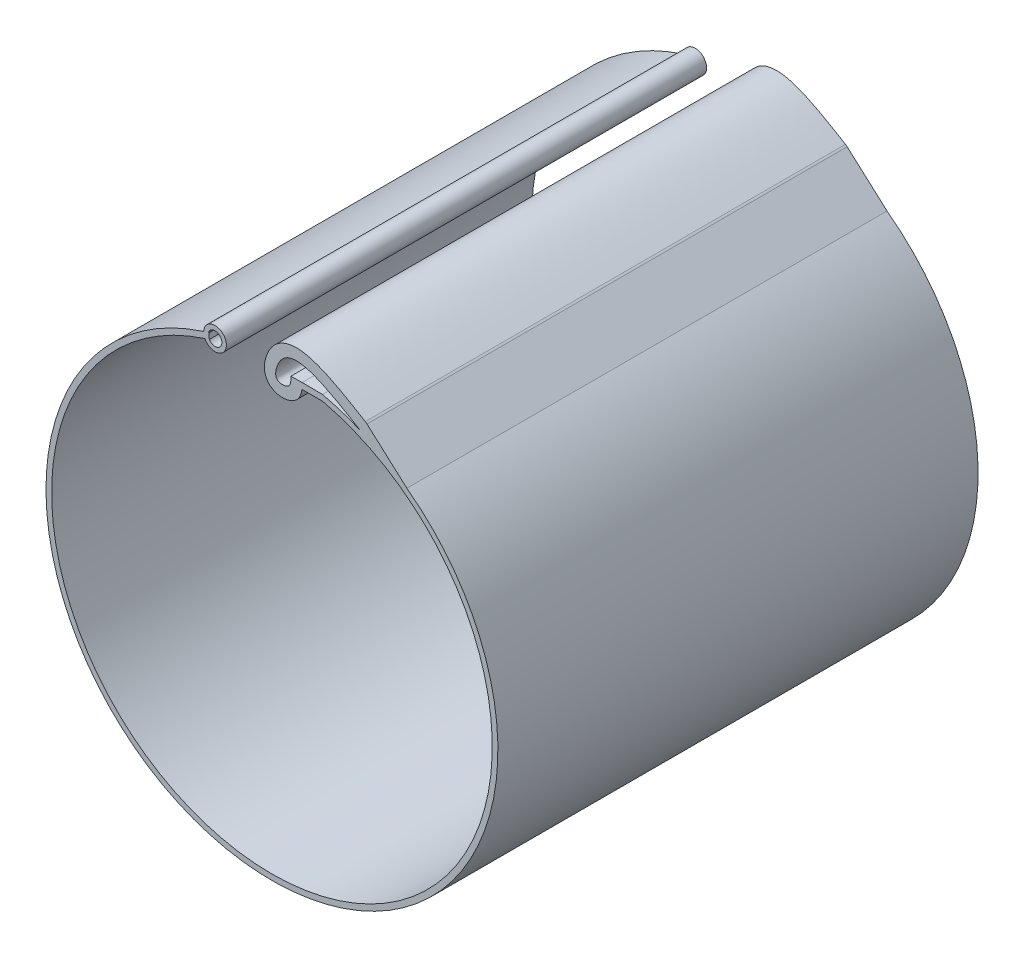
ISO-10303-21;
HEADER;
FILE_DESCRIPTION(('STEP AP214'),'2;1');
FILE_NAME('part.step','',(''),(''),'','','');
FILE_SCHEMA(('AUTOMOTIVE_DESIGN { 1 0 10303 214 1 1 1 1 }'));
ENDSEC;
DATA;
#1=APPLICATION_CONTEXT('core data for automotive mechanical design processes');
#2=APPLICATION_PROTOCOL_DEFINITION('international standard','automotive_design',2000,#1);
#3=PRODUCT_CONTEXT('',#1,'mechanical');
#4=PRODUCT('Part','Part','',(#3));
#5=PRODUCT_RELATED_PRODUCT_CATEGORY('part','',(#4));
#6=PRODUCT_DEFINITION_FORMATION('','',#4);
#7=PRODUCT_DEFINITION_CONTEXT('part definition',#1,'design');
#8=PRODUCT_DEFINITION('design','',#6,#7);
#9=PRODUCT_DEFINITION_SHAPE('','',#8);
#10=(LENGTH_UNIT() NAMED_UNIT(*) SI_UNIT(.MILLI.,.METRE.));
#11=(NAMED_UNIT(*) PLANE_ANGLE_UNIT() SI_UNIT($,.RADIAN.));
#12=(NAMED_UNIT(*) SI_UNIT($,.STERADIAN.) SOLID_ANGLE_UNIT());
#13=UNCERTAINTY_MEASURE_WITH_UNIT(LENGTH_MEASURE(1.E-05),#10,'distance_accuracy_value','');
#14=(GEOMETRIC_REPRESENTATION_CONTEXT(3) GLOBAL_UNCERTAINTY_ASSIGNED_CONTEXT((#13)) GLOBAL_UNIT_ASSIGNED_CONTEXT((#10,
#11,#12)) REPRESENTATION_CONTEXT('',''));
#15=CARTESIAN_POINT('',(0.,0.,0.));
#16=DIRECTION('',(0.,0.,1.));
#17=DIRECTION('',(1.,0.,0.));
#18=AXIS2_PLACEMENT_3D('',#15,#16,#17);
#19=CARTESIAN_POINT('',(6.78343566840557,49.5560398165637,-35.3801183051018));
#20=CARTESIAN_POINT('',(6.78636089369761,49.381244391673,-35.3801183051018));
#21=CARTESIAN_POINT('',(6.79219193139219,49.0584914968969,-35.3801183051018));
#22=CARTESIAN_POINT('',(6.77588924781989,48.4130139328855,-35.3801183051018));
#23=CARTESIAN_POINT('',(6.68189546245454,47.654921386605,-35.3801183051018));
#24=CARTESIAN_POINT('',(6.40887164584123,46.7400923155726,-35.3801183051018));
#25=CARTESIAN_POINT('',(5.89603806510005,45.9084718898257,-35.3801183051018));
#26=CARTESIAN_POINT('',(5.27434765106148,45.3276309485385,-35.3801183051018));
#27=CARTESIAN_POINT('',(4.63102221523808,44.9013269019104,-35.3801183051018));
#28=CARTESIAN_POINT('',(3.84547745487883,44.5840613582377,-35.3801183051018));
#29=CARTESIAN_POINT('',(2.92820073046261,44.4075050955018,-35.3801183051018));
#30=CARTESIAN_POINT('',(2.0088844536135,44.3912916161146,-35.3801183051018));
#31=CARTESIAN_POINT('',(1.0576059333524,44.5478604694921,-35.3801183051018));
#32=CARTESIAN_POINT('',(0.209510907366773,44.8862011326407,-35.3801183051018));
#33=CARTESIAN_POINT('',(-0.494715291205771,45.3977391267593,-35.3801183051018));
#34=CARTESIAN_POINT('',(-1.12567048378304,46.0872518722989,-35.3801183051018));
#35=CARTESIAN_POINT('',(-1.56694919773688,47.0320088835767,-35.3801183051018));
#36=CARTESIAN_POINT('',(-1.72123436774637,48.029437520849,-35.3801183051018));
#37=CARTESIAN_POINT('',(-1.69265827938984,48.8723229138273,-35.3801183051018));
#38=CARTESIAN_POINT('',(-1.52853335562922,49.8578066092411,-35.3801183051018));
#39=CARTESIAN_POINT('',(-1.21259029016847,50.8702288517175,-35.3801183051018));
#40=CARTESIAN_POINT('',(-0.74789788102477,51.9469770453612,-35.3801183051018));
#41=CARTESIAN_POINT('',(-0.144994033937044,52.9385397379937,-35.3801183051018));
#42=CARTESIAN_POINT('',(0.840566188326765,54.1022162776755,-35.3801183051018));
#43=CARTESIAN_POINT('',(2.41065918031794,55.1808248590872,-35.3801183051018));
#44=CARTESIAN_POINT('',(4.51104114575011,55.7203292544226,-35.3801183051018));
#45=CARTESIAN_POINT('',(6.57493501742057,55.6874203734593,-35.3801183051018));
#46=CARTESIAN_POINT('',(8.60172449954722,55.2771898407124,-35.3801183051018));
#47=CARTESIAN_POINT('',(10.6328352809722,54.5926931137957,-35.3801183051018));
#48=CARTESIAN_POINT('',(13.379183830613,53.3980550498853,-35.3801183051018));
#49=CARTESIAN_POINT('',(16.903298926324,51.4974200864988,-35.3801183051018));
#50=CARTESIAN_POINT('',(19.7682073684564,49.7777451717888,-35.3801183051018));
#51=CARTESIAN_POINT('',(21.1855773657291,48.9270399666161,-35.3801183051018));
#52=B_SPLINE_CURVE_WITH_KNOTS('',3,(#19,#20,#21,#22,#23,#24,#25,#26,#27,#28,#29,#30,#31,#32,#33,
#34,#35,#36,#37,#38,#39,#40,#41,#42,#43,#44,#45,#46,#47,#48,#49,#50,#51),.UNSPECIFIED.,.F.,.F.,
(4,1,1,1,1,1,1,1,1,1,1,1,1,1,1,1,1,1,1,1,1,1,1,1,1,1,1,1,1,1,4),(0.,0.015625,0.03125,0.046875,
0.0625,0.078125,0.0859375,0.09375,0.109375,0.125,0.140625,0.15625,0.171875,0.1796875,0.1875,
0.203125,0.21875,0.234375,0.25,0.28125,0.3125,0.34375,0.375,0.4375,0.5,0.5625,0.625,0.6875,0.75,
0.875,1.),.UNSPECIFIED.);
#53=DIRECTION('',(0.,0.,1.));
#54=VECTOR('',#53,1.);
#55=SURFACE_OF_LINEAR_EXTRUSION('',#52,#54);
#56=CARTESIAN_POINT('',(6.78343566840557,49.5560398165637,107.95));
#57=CARTESIAN_POINT('',(6.78636089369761,49.381244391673,107.95));
#58=CARTESIAN_POINT('',(6.79219193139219,49.0584914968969,107.95));
#59=CARTESIAN_POINT('',(6.77588924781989,48.4130139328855,107.95));
#60=CARTESIAN_POINT('',(6.68189546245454,47.654921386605,107.95));
#61=CARTESIAN_POINT('',(6.40887164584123,46.7400923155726,107.95));
#62=CARTESIAN_POINT('',(5.89603806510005,45.9084718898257,107.95));
#63=CARTESIAN_POINT('',(5.27434765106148,45.3276309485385,107.95));
#64=CARTESIAN_POINT('',(4.63102221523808,44.9013269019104,107.95));
#65=CARTESIAN_POINT('',(3.84547745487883,44.5840613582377,107.95));
#66=CARTESIAN_POINT('',(2.92820073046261,44.4075050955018,107.95));
#67=CARTESIAN_POINT('',(2.0088844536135,44.3912916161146,107.95));
#68=CARTESIAN_POINT('',(1.0576059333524,44.5478604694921,107.95));
#69=CARTESIAN_POINT('',(0.209510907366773,44.8862011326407,107.95));
#70=CARTESIAN_POINT('',(-0.494715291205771,45.3977391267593,107.95));
#71=CARTESIAN_POINT('',(-1.12567048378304,46.0872518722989,107.95));
#72=CARTESIAN_POINT('',(-1.56694919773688,47.0320088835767,107.95));
#73=CARTESIAN_POINT('',(-1.72123436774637,48.029437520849,107.95));
#74=CARTESIAN_POINT('',(-1.69265827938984,48.8723229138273,107.95));
#75=CARTESIAN_POINT('',(-1.52853335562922,49.8578066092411,107.95));
#76=CARTESIAN_POINT('',(-1.21259029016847,50.8702288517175,107.95));
#77=CARTESIAN_POINT('',(-0.74789788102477,51.9469770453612,107.95));
#78=CARTESIAN_POINT('',(-0.144994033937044,52.9385397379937,107.95));
#79=CARTESIAN_POINT('',(0.840566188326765,54.1022162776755,107.95));
#80=CARTESIAN_POINT('',(2.41065918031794,55.1808248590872,107.95));
#81=CARTESIAN_POINT('',(4.51104114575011,55.7203292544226,107.95));
#82=CARTESIAN_POINT('',(6.57493501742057,55.6874203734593,107.95));
#83=CARTESIAN_POINT('',(8.60172449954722,55.2771898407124,107.95));
#84=CARTESIAN_POINT('',(10.6328352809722,54.5926931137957,107.95));
#85=CARTESIAN_POINT('',(13.379183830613,53.3980550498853,107.95));
#86=CARTESIAN_POINT('',(16.903298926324,51.4974200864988,107.95));
#87=CARTESIAN_POINT('',(19.7682073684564,49.7777451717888,107.95));
#88=CARTESIAN_POINT('',(21.1855773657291,48.9270399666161,107.95));
#89=B_SPLINE_CURVE_WITH_KNOTS('',3,(#56,#57,#58,#59,#60,#61,#62,#63,#64,#65,#66,#67,#68,#69,#70,
#71,#72,#73,#74,#75,#76,#77,#78,#79,#80,#81,#82,#83,#84,#85,#86,#87,#88),.UNSPECIFIED.,.F.,.F.,
(4,1,1,1,1,1,1,1,1,1,1,1,1,1,1,1,1,1,1,1,1,1,1,1,1,1,1,1,1,1,4),(0.,0.015625,0.03125,0.046875,
0.0625,0.078125,0.0859375,0.09375,0.109375,0.125,0.140625,0.15625,0.171875,0.1796875,0.1875,
0.203125,0.21875,0.234375,0.25,0.28125,0.3125,0.34375,0.375,0.4375,0.5,0.5625,0.625,0.6875,0.75,
0.875,1.),.UNSPECIFIED.);
#90=CARTESIAN_POINT('',(6.74493362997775,48.2009473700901,107.95));
#91=VERTEX_POINT('',#90);
#92=CARTESIAN_POINT('',(20.9792078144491,49.050898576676,107.95));
#93=VERTEX_POINT('',#92);
#94=EDGE_CURVE('E150',#91,#93,#89,.T.);
#95=ORIENTED_EDGE('',*,*,#94,.T.);
#96=DIRECTION('',(0.,0.,1.));
#97=VECTOR('',#96,1.);
#98=CARTESIAN_POINT('',(20.9792078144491,49.050898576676,107.95));
#99=LINE('',#98,#97);
#100=CARTESIAN_POINT('',(20.9792078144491,49.050898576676,0.));
#101=VERTEX_POINT('',#100);
#102=EDGE_CURVE('E39',#93,#101,#99,.F.);
#103=ORIENTED_EDGE('',*,*,#102,.T.);
#104=CARTESIAN_POINT('',(6.78343566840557,49.5560398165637,0.));
#105=CARTESIAN_POINT('',(6.78636089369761,49.381244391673,0.));
#106=CARTESIAN_POINT('',(6.79219193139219,49.0584914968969,0.));
#107=CARTESIAN_POINT('',(6.77588924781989,48.4130139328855,0.));
#108=CARTESIAN_POINT('',(6.68189546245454,47.654921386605,0.));
#109=CARTESIAN_POINT('',(6.40887164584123,46.7400923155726,0.));
#110=CARTESIAN_POINT('',(5.89603806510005,45.9084718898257,0.));
#111=CARTESIAN_POINT('',(5.27434765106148,45.3276309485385,0.));
#112=CARTESIAN_POINT('',(4.63102221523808,44.9013269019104,0.));
#113=CARTESIAN_POINT('',(3.84547745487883,44.5840613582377,0.));
#114=CARTESIAN_POINT('',(2.92820073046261,44.4075050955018,0.));
#115=CARTESIAN_POINT('',(2.0088844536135,44.3912916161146,0.));
#116=CARTESIAN_POINT('',(1.0576059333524,44.5478604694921,0.));
#117=CARTESIAN_POINT('',(0.209510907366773,44.8862011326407,0.));
#118=CARTESIAN_POINT('',(-0.494715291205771,45.3977391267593,0.));
#119=CARTESIAN_POINT('',(-1.12567048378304,46.0872518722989,0.));
#120=CARTESIAN_POINT('',(-1.56694919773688,47.0320088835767,0.));
#121=CARTESIAN_POINT('',(-1.72123436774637,48.029437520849,0.));
#122=CARTESIAN_POINT('',(-1.69265827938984,48.8723229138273,0.));
#123=CARTESIAN_POINT('',(-1.52853335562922,49.8578066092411,0.));
#124=CARTESIAN_POINT('',(-1.21259029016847,50.8702288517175,0.));
#125=CARTESIAN_POINT('',(-0.74789788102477,51.9469770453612,0.));
#126=CARTESIAN_POINT('',(-0.144994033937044,52.9385397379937,0.));
#127=CARTESIAN_POINT('',(0.840566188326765,54.1022162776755,0.));
#128=CARTESIAN_POINT('',(2.41065918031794,55.1808248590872,0.));
#129=CARTESIAN_POINT('',(4.51104114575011,55.7203292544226,0.));
#130=CARTESIAN_POINT('',(6.57493501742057,55.6874203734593,0.));
#131=CARTESIAN_POINT('',(8.60172449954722,55.2771898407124,0.));
#132=CARTESIAN_POINT('',(10.6328352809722,54.5926931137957,0.));
#133=CARTESIAN_POINT('',(13.379183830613,53.3980550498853,0.));
#134=CARTESIAN_POINT('',(16.903298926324,51.4974200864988,0.));
#135=CARTESIAN_POINT('',(19.7682073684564,49.7777451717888,0.));
#136=CARTESIAN_POINT('',(21.1855773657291,48.9270399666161,0.));
#137=B_SPLINE_CURVE_WITH_KNOTS('',3,(#104,#105,#106,#107,#108,#109,#110,#111,#112,#113,#114,
#115,#116,#117,#118,#119,#120,#121,#122,#123,#124,#125,#126,#127,#128,#129,#130,#131,#132,#133,
#134,#135,#136),.UNSPECIFIED.,.F.,.F.,(4,1,1,1,1,1,1,1,1,1,1,1,1,1,1,1,1,1,1,1,1,1,1,1,1,1,1,1,
1,1,4),(0.,0.015625,0.03125,0.046875,0.0625,0.078125,0.0859375,0.09375,0.109375,0.125,0.140625,
0.15625,0.171875,0.1796875,0.1875,0.203125,0.21875,0.234375,0.25,0.28125,0.3125,0.34375,0.375,
0.4375,0.5,0.5625,0.625,0.6875,0.75,0.875,1.),.UNSPECIFIED.);
#138=CARTESIAN_POINT('',(6.74493362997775,48.2009473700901,0.));
#139=VERTEX_POINT('',#138);
#140=EDGE_CURVE('E225',#101,#139,#137,.F.);
#141=ORIENTED_EDGE('',*,*,#140,.T.);
#142=DIRECTION('',(0.,0.,1.));
#143=VECTOR('',#142,1.);
#144=CARTESIAN_POINT('',(6.74493362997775,48.2009473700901,-4.84532420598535));
#145=LINE('',#144,#143);
#146=EDGE_CURVE('E304',#139,#91,#145,.T.);
#147=ORIENTED_EDGE('',*,*,#146,.T.);
#148=EDGE_LOOP('',(#95,#103,#141,#147));
#149=FACE_BOUND('',#148,.T.);
#150=ADVANCED_FACE('F31',(#149),#55,.F.);
#151=CARTESIAN_POINT('',(0.,0.,107.95));
#152=DIRECTION('',(0.,0.,-1.));
#153=DIRECTION('',(-1.,0.,0.));
#154=AXIS2_PLACEMENT_3D('',#151,#152,#153);
#155=CYLINDRICAL_SURFACE('',#154,50.8);
#156=DIRECTION('',(0.,0.,1.));
#157=VECTOR('',#156,1.);
#158=CARTESIAN_POINT('',(30.3348883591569,40.74843000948,-35.3801183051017));
#159=LINE('',#158,#157);
#160=CARTESIAN_POINT('',(30.3348883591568,40.74843000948,0.));
#161=VERTEX_POINT('',#160);
#162=CARTESIAN_POINT('',(30.3348883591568,40.74843000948,107.95));
#163=VERTEX_POINT('',#162);
#164=EDGE_CURVE('E204',#161,#163,#159,.T.);
#165=ORIENTED_EDGE('',*,*,#164,.T.);
#166=CARTESIAN_POINT('',(0.,0.,107.95));
#167=DIRECTION('',(0.,0.,1.));
#168=DIRECTION('',(1.,0.,0.));
#169=AXIS2_PLACEMENT_3D('',#166,#167,#168);
#170=CIRCLE('',#169,50.8);
#171=CARTESIAN_POINT('',(-15.3477671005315,48.4260884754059,107.95));
#172=VERTEX_POINT('',#171);
#173=EDGE_CURVE('E167',#172,#163,#170,.T.);
#174=ORIENTED_EDGE('',*,*,#173,.F.);
#175=DIRECTION('',(0.,0.,1.));
#176=VECTOR('',#175,1.);
#177=CARTESIAN_POINT('',(-15.3477671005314,48.4260884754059,53.975));
#178=LINE('',#177,#176);
#179=CARTESIAN_POINT('',(-15.3477671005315,48.4260884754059,0.));
#180=VERTEX_POINT('',#179);
#181=EDGE_CURVE('E233',#172,#180,#178,.F.);
#182=ORIENTED_EDGE('',*,*,#181,.T.);
#183=CARTESIAN_POINT('',(0.,0.,0.));
#184=DIRECTION('',(0.,0.,1.));
#185=DIRECTION('',(1.,0.,0.));
#186=AXIS2_PLACEMENT_3D('',#183,#184,#185);
#187=CIRCLE('',#186,50.8);
#188=EDGE_CURVE('E171',#180,#161,#187,.T.);
#189=ORIENTED_EDGE('',*,*,#188,.T.);
#190=EDGE_LOOP('',(#165,#174,#182,#189));
#191=FACE_BOUND('',#190,.T.);
#192=ADVANCED_FACE('F265',(#191),#155,.T.);
#193=DIRECTION('',(0.,0.,1.));
#194=VECTOR('',#193,1.);
#195=CARTESIAN_POINT('',(-14.2711679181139,48.754217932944,53.975));
#196=LINE('',#195,#194);
#197=CARTESIAN_POINT('',(-14.2711679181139,48.754217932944,107.95));
#198=VERTEX_POINT('',#197);
#199=CARTESIAN_POINT('',(-14.2711679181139,48.754217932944,0.));
#200=VERTEX_POINT('',#199);
#201=EDGE_CURVE('E229',#198,#200,#196,.F.);
#202=ORIENTED_EDGE('',*,*,#201,.F.);
#203=CARTESIAN_POINT('',(-14.1248530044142,48.7968085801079,107.95));
#204=VERTEX_POINT('',#203);
#205=EDGE_CURVE('E164',#204,#198,#170,.T.);
#206=ORIENTED_EDGE('',*,*,#205,.F.);
#207=DIRECTION('',(0.,0.,-1.));
#208=VECTOR('',#207,1.);
#209=CARTESIAN_POINT('',(-14.1248530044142,48.7968085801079,107.95));
#210=LINE('',#209,#208);
#211=CARTESIAN_POINT('',(-14.1248530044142,48.7968085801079,0.));
#212=VERTEX_POINT('',#211);
#213=EDGE_CURVE('E156',#204,#212,#210,.T.);
#214=ORIENTED_EDGE('',*,*,#213,.T.);
#215=EDGE_CURVE('E169',#212,#200,#187,.T.);
#216=ORIENTED_EDGE('',*,*,#215,.T.);
#217=EDGE_LOOP('',(#202,#206,#214,#216));
#218=FACE_BOUND('',#217,.T.);
#219=ADVANCED_FACE('F251',(#218),#155,.T.);
#220=CARTESIAN_POINT('',(19.878438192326,46.7491999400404,107.95));
#221=VERTEX_POINT('',#220);
#222=CARTESIAN_POINT('',(11.3599957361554,49.5135385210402,107.95));
#223=VERTEX_POINT('',#222);
#224=EDGE_CURVE('E168',#221,#223,#170,.T.);
#225=ORIENTED_EDGE('',*,*,#224,.F.);
#226=DIRECTION('',(0.,0.,1.));
#227=VECTOR('',#226,1.);
#228=CARTESIAN_POINT('',(19.8784381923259,46.7491999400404,-35.3801183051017));
#229=LINE('',#228,#227);
#230=CARTESIAN_POINT('',(19.878438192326,46.7491999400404,0.));
#231=VERTEX_POINT('',#230);
#232=EDGE_CURVE('E208',#231,#221,#229,.T.);
#233=ORIENTED_EDGE('',*,*,#232,.F.);
#234=CARTESIAN_POINT('',(11.3599957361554,49.5135385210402,0.));
#235=VERTEX_POINT('',#234);
#236=EDGE_CURVE('E158',#231,#235,#187,.T.);
#237=ORIENTED_EDGE('',*,*,#236,.T.);
#238=DIRECTION('',(0.,0.,-1.));
#239=VECTOR('',#238,1.);
#240=CARTESIAN_POINT('',(11.3599957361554,49.5135385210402,107.95));
#241=LINE('',#240,#239);
#242=EDGE_CURVE('E237',#235,#223,#241,.F.);
#243=ORIENTED_EDGE('',*,*,#242,.T.);
#244=EDGE_LOOP('',(#225,#233,#237,#243));
#245=FACE_BOUND('',#244,.T.);
#246=ADVANCED_FACE('F271',(#245),#155,.T.);
#247=CARTESIAN_POINT('',(0.,0.,107.95));
#248=DIRECTION('',(0.,0.,1.));
#249=DIRECTION('',(1.,0.,0.));
#250=AXIS2_PLACEMENT_3D('',#247,#248,#249);
#251=PLANE('',#250);
#252=ORIENTED_EDGE('',*,*,#224,.T.);
#253=DIRECTION('',(-0.999956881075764,0.00928633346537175,0.));
#254=VECTOR('',#253,1.);
#255=CARTESIAN_POINT('',(1.49883760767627,49.6051164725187,107.95));
#256=LINE('',#255,#254);
#257=CARTESIAN_POINT('',(6.78343566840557,49.5560398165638,107.95));
#258=VERTEX_POINT('',#257);
#259=EDGE_CURVE('E151',#223,#258,#256,.T.);
#260=ORIENTED_EDGE('',*,*,#259,.T.);
#261=DIRECTION('',(0.999859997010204,0.0167327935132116,0.));
#262=VECTOR('',#261,1.);
#263=CARTESIAN_POINT('',(-2.69831840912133,49.3973613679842,107.95));
#264=LINE('',#263,#262);
#265=CARTESIAN_POINT('',(4.24379127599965,49.5135385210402,107.95));
#266=VERTEX_POINT('',#265);
#267=EDGE_CURVE('E178',#266,#258,#264,.T.);
#268=ORIENTED_EDGE('',*,*,#267,.F.);
#269=CARTESIAN_POINT('',(4.24379127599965,49.5135385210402,107.95));
#270=CARTESIAN_POINT('',(4.25780221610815,48.6763215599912,107.95));
#271=CARTESIAN_POINT('',(4.28799004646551,46.8724623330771,107.95));
#272=CARTESIAN_POINT('',(0.417675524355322,46.7473448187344,107.95));
#273=CARTESIAN_POINT('',(2.39091033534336,57.2452108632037,107.95));
#274=CARTESIAN_POINT('',(11.6828253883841,51.6682052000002,107.95));
#275=CARTESIAN_POINT('',(19.878438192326,46.7491999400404,107.95));
#276=B_SPLINE_CURVE_WITH_KNOTS('',3,(#269,#270,#271,#272,#273,#274,#275),.UNSPECIFIED.,.F.,.F.,
(4,1,1,1,4),(0.,0.0837483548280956,0.180443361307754,0.277138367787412,1.),.UNSPECIFIED.);
#277=EDGE_CURVE('E193',#266,#221,#276,.T.);
#278=ORIENTED_EDGE('',*,*,#277,.T.);
#279=EDGE_LOOP('',(#252,#260,#268,#278));
#280=FACE_BOUND('',#279,.T.);
#281=DIRECTION('',(0.745549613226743,-0.666450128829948,0.));
#282=VECTOR('',#281,1.);
#283=CARTESIAN_POINT('',(89.2899568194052,-11.9517689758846,107.95));
#284=LINE('',#283,#282);
#285=CARTESIAN_POINT('',(21.3649576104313,48.7666911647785,107.95));
#286=VERTEX_POINT('',#285);
#287=EDGE_CURVE('E198',#286,#163,#284,.T.);
#288=ORIENTED_EDGE('',*,*,#287,.F.);
#289=CARTESIAN_POINT('',(19.6721742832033,46.8729951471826,107.95));
#290=DIRECTION('',(0.,0.,1.));
#291=DIRECTION('',(1.,0.,0.));
#292=AXIS2_PLACEMENT_3D('',#289,#290,#291);
#293=CIRCLE('',#292,2.54);
#294=EDGE_CURVE('E53',#286,#93,#293,.T.);
#295=ORIENTED_EDGE('',*,*,#294,.T.);
#296=ORIENTED_EDGE('',*,*,#94,.F.);
#297=DIRECTION('',(-1.,0.,0.));
#298=VECTOR('',#297,1.);
#299=CARTESIAN_POINT('',(0.,48.2009473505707,107.95));
#300=LINE('',#299,#298);
#301=CARTESIAN_POINT('',(11.3969107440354,48.2009473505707,107.95));
#302=VERTEX_POINT('',#301);
#303=EDGE_CURVE('E135',#302,#91,#300,.T.);
#304=ORIENTED_EDGE('',*,*,#303,.F.);
#305=CARTESIAN_POINT('',(0.,0.,107.95));
#306=DIRECTION('',(0.,0.,1.));
#307=DIRECTION('',(1.,0.,0.));
#308=AXIS2_PLACEMENT_3D('',#305,#306,#307);
#309=CIRCLE('',#308,49.53);
#310=CARTESIAN_POINT('',(-15.0811759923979,47.1781626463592,107.95));
#311=VERTEX_POINT('',#310);
#312=EDGE_CURVE('E148',#311,#302,#309,.T.);
#313=ORIENTED_EDGE('',*,*,#312,.F.);
#314=CARTESIAN_POINT('',(-12.7952335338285,48.3189410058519,107.95));
#315=DIRECTION('',(0.,0.,1.));
#316=DIRECTION('',(1.,0.,0.));
#317=AXIS2_PLACEMENT_3D('',#314,#315,#316);
#318=CIRCLE('',#317,2.55478143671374);
#319=EDGE_CURVE('E221',#311,#172,#318,.T.);
#320=ORIENTED_EDGE('',*,*,#319,.T.);
#321=ORIENTED_EDGE('',*,*,#173,.T.);
#322=EDGE_LOOP('',(#288,#295,#296,#304,#313,#320,#321));
#323=FACE_BOUND('',#322,.T.);
#324=ORIENTED_EDGE('',*,*,#205,.T.);
#325=CARTESIAN_POINT('',(-12.7952335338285,48.3189410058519,107.95));
#326=DIRECTION('',(0.,0.,1.));
#327=DIRECTION('',(1.,0.,0.));
#328=AXIS2_PLACEMENT_3D('',#325,#326,#327);
#329=CIRCLE('',#328,1.53878143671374);
#330=CARTESIAN_POINT('',(-14.0879379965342,47.4842174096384,107.95));
#331=VERTEX_POINT('',#330);
#332=EDGE_CURVE('E222',#331,#198,#329,.T.);
#333=ORIENTED_EDGE('',*,*,#332,.F.);
#334=DIRECTION('',(0.0281126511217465,-0.999604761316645,0.));
#335=VECTOR('',#334,1.);
#336=CARTESIAN_POINT('',(-14.0879379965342,47.4842174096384,107.95));
#337=LINE('',#336,#335);
#338=EDGE_CURVE('E235',#204,#331,#337,.T.);
#339=ORIENTED_EDGE('',*,*,#338,.F.);
#340=EDGE_LOOP('',(#324,#333,#339));
#341=FACE_BOUND('',#340,.T.);
#342=ADVANCED_FACE('F145',(#280,#323,#341),#251,.T.);
#343=CARTESIAN_POINT('',(0.,0.,0.));
#344=DIRECTION('',(0.,0.,1.));
#345=DIRECTION('',(1.,0.,0.));
#346=AXIS2_PLACEMENT_3D('',#343,#344,#345);
#347=PLANE('',#346);
#348=DIRECTION('',(0.999956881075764,-0.00928633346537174,0.));
#349=VECTOR('',#348,1.);
#350=CARTESIAN_POINT('',(1.49883760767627,49.6051164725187,0.));
#351=LINE('',#350,#349);
#352=CARTESIAN_POINT('',(6.78343566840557,49.5560398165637,0.));
#353=VERTEX_POINT('',#352);
#354=EDGE_CURVE('E305',#353,#235,#351,.T.);
#355=ORIENTED_EDGE('',*,*,#354,.T.);
#356=ORIENTED_EDGE('',*,*,#236,.F.);
#357=CARTESIAN_POINT('',(4.24379127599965,49.5135385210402,0.));
#358=CARTESIAN_POINT('',(4.25780221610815,48.6763215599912,0.));
#359=CARTESIAN_POINT('',(4.28799004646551,46.8724623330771,0.));
#360=CARTESIAN_POINT('',(0.417675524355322,46.7473448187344,0.));
#361=CARTESIAN_POINT('',(2.39091033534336,57.2452108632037,0.));
#362=CARTESIAN_POINT('',(11.6828253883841,51.6682052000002,0.));
#363=CARTESIAN_POINT('',(19.878438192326,46.7491999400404,0.));
#364=B_SPLINE_CURVE_WITH_KNOTS('',3,(#357,#358,#359,#360,#361,#362,#363),.UNSPECIFIED.,.F.,.F.,
(4,1,1,1,4),(0.,0.0837483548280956,0.180443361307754,0.277138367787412,1.),.UNSPECIFIED.);
#365=CARTESIAN_POINT('',(4.24379127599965,49.5135385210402,0.));
#366=VERTEX_POINT('',#365);
#367=EDGE_CURVE('E217',#231,#366,#364,.F.);
#368=ORIENTED_EDGE('',*,*,#367,.T.);
#369=DIRECTION('',(-0.999859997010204,-0.0167327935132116,0.));
#370=VECTOR('',#369,1.);
#371=CARTESIAN_POINT('',(-2.69831840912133,49.3973613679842,0.));
#372=LINE('',#371,#370);
#373=EDGE_CURVE('E207',#353,#366,#372,.T.);
#374=ORIENTED_EDGE('',*,*,#373,.F.);
#375=EDGE_LOOP('',(#355,#356,#368,#374));
#376=FACE_BOUND('',#375,.T.);
#377=ORIENTED_EDGE('',*,*,#140,.F.);
#378=CARTESIAN_POINT('',(19.6721742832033,46.8729951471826,0.));
#379=DIRECTION('',(0.,0.,1.));
#380=DIRECTION('',(1.,0.,0.));
#381=AXIS2_PLACEMENT_3D('',#378,#379,#380);
#382=CIRCLE('',#381,2.54);
#383=CARTESIAN_POINT('',(21.3649576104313,48.7666911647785,0.));
#384=VERTEX_POINT('',#383);
#385=EDGE_CURVE('E11',#101,#384,#382,.F.);
#386=ORIENTED_EDGE('',*,*,#385,.T.);
#387=DIRECTION('',(-0.745549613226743,0.666450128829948,0.));
#388=VECTOR('',#387,1.);
#389=CARTESIAN_POINT('',(89.2899568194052,-11.9517689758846,0.));
#390=LINE('',#389,#388);
#391=EDGE_CURVE('E287',#161,#384,#390,.T.);
#392=ORIENTED_EDGE('',*,*,#391,.F.);
#393=ORIENTED_EDGE('',*,*,#188,.F.);
#394=CARTESIAN_POINT('',(-12.7952335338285,48.3189410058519,0.));
#395=DIRECTION('',(0.,0.,1.));
#396=DIRECTION('',(1.,0.,0.));
#397=AXIS2_PLACEMENT_3D('',#394,#395,#396);
#398=CIRCLE('',#397,2.55478143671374);
#399=CARTESIAN_POINT('',(-15.0811759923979,47.1781626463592,0.));
#400=VERTEX_POINT('',#399);
#401=EDGE_CURVE('E226',#400,#180,#398,.T.);
#402=ORIENTED_EDGE('',*,*,#401,.F.);
#403=CARTESIAN_POINT('',(0.,0.,0.));
#404=DIRECTION('',(0.,0.,1.));
#405=DIRECTION('',(1.,0.,0.));
#406=AXIS2_PLACEMENT_3D('',#403,#404,#405);
#407=CIRCLE('',#406,49.53);
#408=CARTESIAN_POINT('',(11.3969107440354,48.2009473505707,0.));
#409=VERTEX_POINT('',#408);
#410=EDGE_CURVE('E155',#400,#409,#407,.T.);
#411=ORIENTED_EDGE('',*,*,#410,.T.);
#412=DIRECTION('',(1.,0.,0.));
#413=VECTOR('',#412,1.);
#414=CARTESIAN_POINT('',(0.,48.2009473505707,0.));
#415=LINE('',#414,#413);
#416=EDGE_CURVE('E137',#139,#409,#415,.T.);
#417=ORIENTED_EDGE('',*,*,#416,.F.);
#418=EDGE_LOOP('',(#377,#386,#392,#393,#402,#411,#417));
#419=FACE_BOUND('',#418,.T.);
#420=CARTESIAN_POINT('',(-12.7952335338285,48.3189410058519,0.));
#421=DIRECTION('',(0.,0.,1.));
#422=DIRECTION('',(1.,0.,0.));
#423=AXIS2_PLACEMENT_3D('',#420,#421,#422);
#424=CIRCLE('',#423,1.53878143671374);
#425=CARTESIAN_POINT('',(-14.0879379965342,47.4842174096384,0.));
#426=VERTEX_POINT('',#425);
#427=EDGE_CURVE('E218',#426,#200,#424,.T.);
#428=ORIENTED_EDGE('',*,*,#427,.T.);
#429=ORIENTED_EDGE('',*,*,#215,.F.);
#430=DIRECTION('',(0.0281126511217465,-0.999604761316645,0.));
#431=VECTOR('',#430,1.);
#432=CARTESIAN_POINT('',(-12.7424243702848,-0.358364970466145,0.));
#433=LINE('',#432,#431);
#434=EDGE_CURVE('E161',#212,#426,#433,.T.);
#435=ORIENTED_EDGE('',*,*,#434,.T.);
#436=EDGE_LOOP('',(#428,#429,#435));
#437=FACE_BOUND('',#436,.T.);
#438=ADVANCED_FACE('F244',(#376,#419,#437),#347,.F.);
#439=CARTESIAN_POINT('',(0.,0.,0.));
#440=DIRECTION('',(0.,0.,1.));
#441=DIRECTION('',(1.,0.,0.));
#442=AXIS2_PLACEMENT_3D('',#439,#440,#441);
#443=CYLINDRICAL_SURFACE('',#442,49.53);
#444=ORIENTED_EDGE('',*,*,#410,.F.);
#445=DIRECTION('',(0.,0.,1.));
#446=VECTOR('',#445,1.);
#447=CARTESIAN_POINT('',(-15.0811759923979,47.1781626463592,53.975));
#448=LINE('',#447,#446);
#449=EDGE_CURVE('E141',#400,#311,#448,.T.);
#450=ORIENTED_EDGE('',*,*,#449,.T.);
#451=ORIENTED_EDGE('',*,*,#312,.T.);
#452=DIRECTION('',(0.,0.,1.));
#453=VECTOR('',#452,1.);
#454=CARTESIAN_POINT('',(11.3969107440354,48.2009473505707,0.));
#455=LINE('',#454,#453);
#456=EDGE_CURVE('E131',#302,#409,#455,.F.);
#457=ORIENTED_EDGE('',*,*,#456,.T.);
#458=EDGE_LOOP('',(#444,#450,#451,#457));
#459=FACE_BOUND('',#458,.T.);
#460=ADVANCED_FACE('F153',(#459),#443,.F.);
#461=CARTESIAN_POINT('',(-14.0879379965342,47.4842174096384,-19.05));
#462=DIRECTION('',(-0.999604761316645,-0.0281126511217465,0.));
#463=DIRECTION('',(0.0281126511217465,-0.999604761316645,0.));
#464=AXIS2_PLACEMENT_3D('',#461,#462,#463);
#465=PLANE('',#464);
#466=ORIENTED_EDGE('',*,*,#338,.T.);
#467=DIRECTION('',(0.,0.,1.));
#468=VECTOR('',#467,1.);
#469=CARTESIAN_POINT('',(-14.0879379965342,47.4842174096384,0.));
#470=LINE('',#469,#468);
#471=EDGE_CURVE('E142',#426,#331,#470,.T.);
#472=ORIENTED_EDGE('',*,*,#471,.F.);
#473=ORIENTED_EDGE('',*,*,#434,.F.);
#474=ORIENTED_EDGE('',*,*,#213,.F.);
#475=EDGE_LOOP('',(#466,#472,#473,#474));
#476=FACE_BOUND('',#475,.T.);
#477=ADVANCED_FACE('F253',(#476),#465,.F.);
#478=CARTESIAN_POINT('',(-12.7952335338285,48.3189410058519,0.));
#479=DIRECTION('',(0.,0.,1.));
#480=DIRECTION('',(1.,0.,0.));
#481=AXIS2_PLACEMENT_3D('',#478,#479,#480);
#482=CYLINDRICAL_SURFACE('',#481,2.55478143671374);
#483=ORIENTED_EDGE('',*,*,#181,.F.);
#484=ORIENTED_EDGE('',*,*,#319,.F.);
#485=ORIENTED_EDGE('',*,*,#449,.F.);
#486=ORIENTED_EDGE('',*,*,#401,.T.);
#487=EDGE_LOOP('',(#483,#484,#485,#486));
#488=FACE_BOUND('',#487,.T.);
#489=ADVANCED_FACE('F255',(#488),#482,.T.);
#490=CARTESIAN_POINT('',(-12.7952335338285,48.3189410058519,0.));
#491=DIRECTION('',(0.,0.,1.));
#492=DIRECTION('',(1.,0.,0.));
#493=AXIS2_PLACEMENT_3D('',#490,#491,#492);
#494=CYLINDRICAL_SURFACE('',#493,1.53878143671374);
#495=ORIENTED_EDGE('',*,*,#332,.T.);
#496=ORIENTED_EDGE('',*,*,#201,.T.);
#497=ORIENTED_EDGE('',*,*,#427,.F.);
#498=ORIENTED_EDGE('',*,*,#471,.T.);
#499=EDGE_LOOP('',(#495,#496,#497,#498));
#500=FACE_BOUND('',#499,.T.);
#501=ADVANCED_FACE('F247',(#500),#494,.F.);
#502=CARTESIAN_POINT('',(-2.69831840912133,49.3973613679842,-35.3801183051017));
#503=DIRECTION('',(0.0167327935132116,-0.999859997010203,0.));
#504=DIRECTION('',(0.999859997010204,0.0167327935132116,0.));
#505=AXIS2_PLACEMENT_3D('',#502,#503,#504);
#506=PLANE('',#505);
#507=DIRECTION('',(0.,0.,1.));
#508=VECTOR('',#507,1.);
#509=CARTESIAN_POINT('',(6.78343566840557,49.5560398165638,-35.3801183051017));
#510=LINE('',#509,#508);
#511=EDGE_CURVE('E203',#353,#258,#510,.T.);
#512=ORIENTED_EDGE('',*,*,#511,.F.);
#513=ORIENTED_EDGE('',*,*,#373,.T.);
#514=DIRECTION('',(0.,0.,1.));
#515=VECTOR('',#514,1.);
#516=CARTESIAN_POINT('',(4.24379127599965,49.5135385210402,-35.3801183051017));
#517=LINE('',#516,#515);
#518=EDGE_CURVE('E211',#366,#266,#517,.T.);
#519=ORIENTED_EDGE('',*,*,#518,.T.);
#520=ORIENTED_EDGE('',*,*,#267,.T.);
#521=EDGE_LOOP('',(#512,#513,#519,#520));
#522=FACE_BOUND('',#521,.T.);
#523=ADVANCED_FACE('F274',(#522),#506,.F.);
#524=CARTESIAN_POINT('',(4.24379127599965,49.5135385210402,-35.3801183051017));
#525=CARTESIAN_POINT('',(4.25780221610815,48.6763215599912,-35.3801183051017));
#526=CARTESIAN_POINT('',(4.28799004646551,46.8724623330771,-35.3801183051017));
#527=CARTESIAN_POINT('',(0.417675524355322,46.7473448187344,-35.3801183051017));
#528=CARTESIAN_POINT('',(2.39091033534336,57.2452108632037,-35.3801183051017));
#529=CARTESIAN_POINT('',(11.6828253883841,51.6682052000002,-35.3801183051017));
#530=CARTESIAN_POINT('',(19.878438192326,46.7491999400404,-35.3801183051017));
#531=B_SPLINE_CURVE_WITH_KNOTS('',3,(#524,#525,#526,#527,#528,#529,#530),.UNSPECIFIED.,.F.,.F.,
(4,1,1,1,4),(0.,0.0837483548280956,0.180443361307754,0.277138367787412,1.),.UNSPECIFIED.);
#532=DIRECTION('',(0.,0.,1.));
#533=VECTOR('',#532,1.);
#534=SURFACE_OF_LINEAR_EXTRUSION('',#531,#533);
#535=ORIENTED_EDGE('',*,*,#367,.F.);
#536=ORIENTED_EDGE('',*,*,#232,.T.);
#537=ORIENTED_EDGE('',*,*,#277,.F.);
#538=ORIENTED_EDGE('',*,*,#518,.F.);
#539=EDGE_LOOP('',(#535,#536,#537,#538));
#540=FACE_BOUND('',#539,.T.);
#541=ADVANCED_FACE('F342',(#540),#534,.T.);
#542=CARTESIAN_POINT('',(89.2899568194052,-11.9517689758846,-35.3801183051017));
#543=DIRECTION('',(-0.666450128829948,-0.745549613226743,0.));
#544=DIRECTION('',(0.745549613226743,-0.666450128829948,0.));
#545=AXIS2_PLACEMENT_3D('',#542,#543,#544);
#546=PLANE('',#545);
#547=ORIENTED_EDGE('',*,*,#391,.T.);
#548=DIRECTION('',(0.,0.,1.));
#549=VECTOR('',#548,1.);
#550=CARTESIAN_POINT('',(21.3649576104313,48.7666911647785,-35.3801183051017));
#551=LINE('',#550,#549);
#552=EDGE_CURVE('E175',#384,#286,#551,.T.);
#553=ORIENTED_EDGE('',*,*,#552,.T.);
#554=ORIENTED_EDGE('',*,*,#287,.T.);
#555=ORIENTED_EDGE('',*,*,#164,.F.);
#556=EDGE_LOOP('',(#547,#553,#554,#555));
#557=FACE_BOUND('',#556,.T.);
#558=ADVANCED_FACE('F325',(#557),#546,.F.);
#559=CARTESIAN_POINT('',(0.,48.2009473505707,-4.84532420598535));
#560=DIRECTION('',(0.,1.,0.));
#561=DIRECTION('',(0.,0.,1.));
#562=AXIS2_PLACEMENT_3D('',#559,#560,#561);
#563=PLANE('',#562);
#564=ORIENTED_EDGE('',*,*,#146,.F.);
#565=ORIENTED_EDGE('',*,*,#416,.T.);
#566=ORIENTED_EDGE('',*,*,#456,.F.);
#567=ORIENTED_EDGE('',*,*,#303,.T.);
#568=EDGE_LOOP('',(#564,#565,#566,#567));
#569=FACE_BOUND('',#568,.T.);
#570=ADVANCED_FACE('F134',(#569),#563,.F.);
#571=CARTESIAN_POINT('',(1.49883760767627,49.6051164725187,-4.84532420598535));
#572=DIRECTION('',(0.00928633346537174,0.999956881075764,0.));
#573=DIRECTION('',(-0.999956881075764,0.00928633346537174,0.));
#574=AXIS2_PLACEMENT_3D('',#571,#572,#573);
#575=PLANE('',#574);
#576=ORIENTED_EDGE('',*,*,#354,.F.);
#577=ORIENTED_EDGE('',*,*,#511,.T.);
#578=ORIENTED_EDGE('',*,*,#259,.F.);
#579=ORIENTED_EDGE('',*,*,#242,.F.);
#580=EDGE_LOOP('',(#576,#577,#578,#579));
#581=FACE_BOUND('',#580,.T.);
#582=ADVANCED_FACE('F339',(#581),#575,.T.);
#583=CARTESIAN_POINT('',(19.6721742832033,46.8729951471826,53.975));
#584=DIRECTION('',(0.,0.,1.));
#585=DIRECTION('',(1.,0.,0.));
#586=AXIS2_PLACEMENT_3D('',#583,#584,#585);
#587=CYLINDRICAL_SURFACE('',#586,2.54);
#588=ORIENTED_EDGE('',*,*,#385,.F.);
#589=ORIENTED_EDGE('',*,*,#102,.F.);
#590=ORIENTED_EDGE('',*,*,#294,.F.);
#591=ORIENTED_EDGE('',*,*,#552,.F.);
#592=EDGE_LOOP('',(#588,#589,#590,#591));
#593=FACE_BOUND('',#592,.T.);
#594=ADVANCED_FACE('F33',(#593),#587,.T.);
#595=CLOSED_SHELL('',(#150,#192,#219,#246,#342,#438,#460,#477,#489,#501,#523,#541,#558,#570,
#582,#594));
#596=MANIFOLD_SOLID_BREP('B2',#595);
#597=ADVANCED_BREP_SHAPE_REPRESENTATION('',(#18,#596),#14);
#598=SHAPE_DEFINITION_REPRESENTATION(#9,#597);
ENDSEC;
END-ISO-10303-21;
